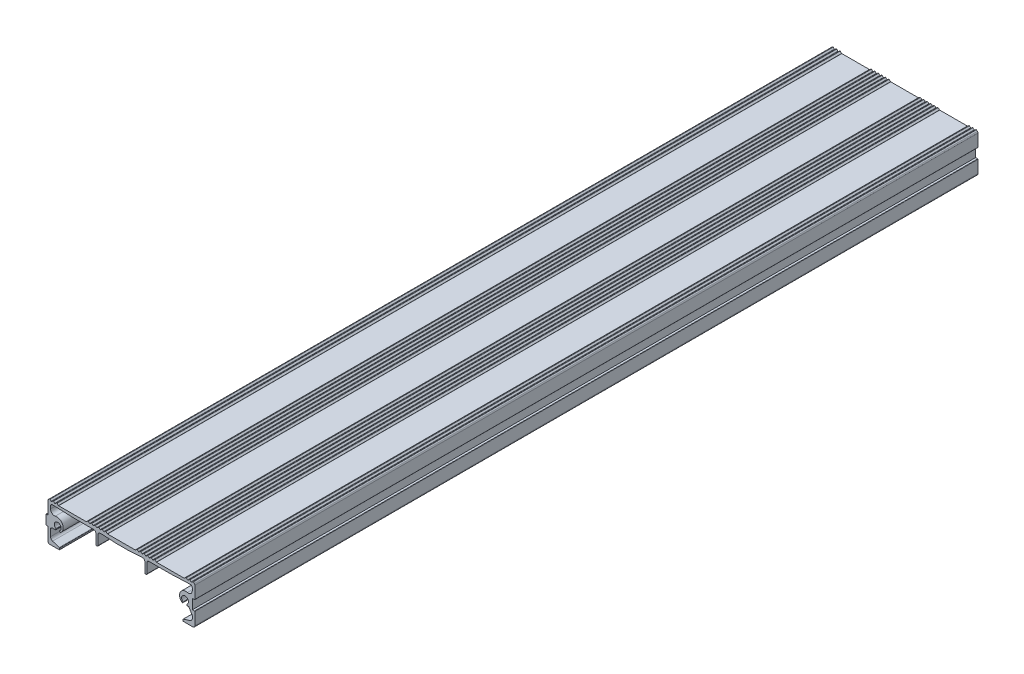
from build123d import *

# Parameters (mm, degrees)
EXTRUDE_1_DEPTH = 800


with BuildPart() as part:
    # Sketch 1 → Extrude 1 (new body)
    with BuildSketch(Plane.XY):
        with BuildLine():
            Line((75.831929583, -4.618869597), (73.731929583, -4.618869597))
            Line((73.731929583, -4.618869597), (73.731929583, 5.381130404))
            Line((73.731929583, 5.381130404), (75.831929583, 5.381130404))
            ThreePointArc((75.831929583, 5.381130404), (76.044061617, 5.46899837), (76.131929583, 5.681130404))
            Line((76.131929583, 5.681130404), (76.131929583, 18.28173049))
            ThreePointArc((76.131929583, 18.28173049), (75.980872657, 18.960379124), (75.556224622, 19.510884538))
            Line((75.556224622, 19.510884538), (74.588003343, 20.317735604))
            ThreePointArc((74.588003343, 20.317735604), (74.331929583, 20.410447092), (74.075855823, 20.317735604))
            Line((74.075855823, 20.317735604), (72.788003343, 19.244525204))
            ThreePointArc((72.788003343, 19.244525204), (72.531929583, 19.151813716), (72.275855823, 19.244525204))
            Line((72.275855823, 19.244525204), (70.988003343, 20.317735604))
            ThreePointArc((70.988003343, 20.317735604), (70.731929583, 20.410447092), (70.475855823, 20.317735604))
            Line((70.475855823, 20.317735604), (69.188003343, 19.244525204))
            ThreePointArc((69.188003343, 19.244525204), (68.931929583, 19.151813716), (68.675855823, 19.244525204))
            Line((68.675855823, 19.244525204), (67.388003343, 20.317735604))
            ThreePointArc((67.388003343, 20.317735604), (67.131929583, 20.410447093), (66.875855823, 20.317735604))
            Line((66.875855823, 20.317735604), (65.443183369, 19.123841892))
            ThreePointArc((65.443183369, 19.123841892), (65.323279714, 19.055021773), (65.187109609, 19.031130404))
            Line((65.187109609, 19.031130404), (37.076749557, 19.031130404))
            ThreePointArc((37.076749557, 19.031130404), (36.940579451, 19.055021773), (36.820675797, 19.123841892))
            Line((36.820675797, 19.123841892), (35.388003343, 20.317735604))
            ThreePointArc((35.388003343, 20.317735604), (35.131929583, 20.410447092), (34.875855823, 20.317735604))
            Line((34.875855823, 20.317735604), (33.588003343, 19.244525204))
            ThreePointArc((33.588003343, 19.244525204), (33.331929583, 19.151813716), (33.075855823, 19.244525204))
            Line((33.075855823, 19.244525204), (31.788003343, 20.317735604))
            ThreePointArc((31.788003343, 20.317735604), (31.531929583, 20.410447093), (31.275855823, 20.317735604))
            Line((31.275855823, 20.317735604), (29.988003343, 19.244525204))
            ThreePointArc((29.988003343, 19.244525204), (29.731929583, 19.151813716), (29.475855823, 19.244525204))
            Line((29.475855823, 19.244525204), (28.188003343, 20.317735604))
            ThreePointArc((28.188003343, 20.317735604), (27.931929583, 20.410447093), (27.675855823, 20.317735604))
            Line((27.675855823, 20.317735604), (26.323984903, 19.191176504))
            ThreePointArc((26.323984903, 19.191176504), (26.131929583, 19.121642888), (25.939874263, 19.191176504))
            Line((25.939874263, 19.191176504), (24.588003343, 20.317735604))
            ThreePointArc((24.588003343, 20.317735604), (24.331929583, 20.410447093), (24.075855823, 20.317735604))
            Line((24.075855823, 20.317735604), (22.788003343, 19.244525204))
            ThreePointArc((22.788003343, 19.244525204), (22.531929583, 19.151813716), (22.275855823, 19.244525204))
            Line((22.275855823, 19.244525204), (20.988003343, 20.317735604))
            ThreePointArc((20.988003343, 20.317735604), (20.731929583, 20.410447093), (20.475855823, 20.317735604))
            Line((20.475855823, 20.317735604), (19.188003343, 19.244525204))
            ThreePointArc((19.188003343, 19.244525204), (18.931929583, 19.151813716), (18.675855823, 19.244525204))
            Line((18.675855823, 19.244525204), (17.388003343, 20.317735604))
            ThreePointArc((17.388003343, 20.317735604), (17.131929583, 20.410447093), (16.875855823, 20.317735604))
            Line((16.875855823, 20.317735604), (15.443183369, 19.123841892))
            ThreePointArc((15.443183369, 19.123841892), (15.323279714, 19.055021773), (15.187109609, 19.031130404))
            Line((15.187109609, 19.031130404), (-12.923250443, 19.031130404))
            ThreePointArc((-12.923250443, 19.031130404), (-13.059420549, 19.055021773), (-13.179324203, 19.123841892))
            Line((-13.179324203, 19.123841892), (-14.611996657, 20.317735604))
            ThreePointArc((-14.611996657, 20.317735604), (-14.868070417, 20.410447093), (-15.124144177, 20.317735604))
            Line((-15.124144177, 20.317735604), (-16.411996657, 19.244525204))
            ThreePointArc((-16.411996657, 19.244525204), (-16.668070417, 19.151813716), (-16.924144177, 19.244525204))
            Line((-16.924144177, 19.244525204), (-18.211996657, 20.317735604))
            ThreePointArc((-18.211996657, 20.317735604), (-18.468070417, 20.410447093), (-18.724144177, 20.317735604))
            Line((-18.724144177, 20.317735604), (-20.011996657, 19.244525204))
            ThreePointArc((-20.011996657, 19.244525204), (-20.268070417, 19.151813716), (-20.524144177, 19.244525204))
            Line((-20.524144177, 19.244525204), (-21.811996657, 20.317735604))
            ThreePointArc((-21.811996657, 20.317735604), (-22.068070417, 20.410447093), (-22.324144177, 20.317735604))
            Line((-22.324144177, 20.317735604), (-23.676015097, 19.191176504))
            ThreePointArc((-23.676015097, 19.191176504), (-23.868070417, 19.121642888), (-24.060125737, 19.191176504))
            Line((-24.060125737, 19.191176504), (-25.411996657, 20.317735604))
            ThreePointArc((-25.411996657, 20.317735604), (-25.668070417, 20.410447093), (-25.924144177, 20.317735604))
            Line((-25.924144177, 20.317735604), (-27.211996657, 19.244525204))
            ThreePointArc((-27.211996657, 19.244525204), (-27.468070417, 19.151813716), (-27.724144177, 19.244525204))
            Line((-27.724144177, 19.244525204), (-29.011996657, 20.317735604))
            ThreePointArc((-29.011996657, 20.317735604), (-29.268070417, 20.410447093), (-29.524144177, 20.317735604))
            Line((-29.524144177, 20.317735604), (-30.811996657, 19.244525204))
            ThreePointArc((-30.811996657, 19.244525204), (-31.068070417, 19.151813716), (-31.324144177, 19.244525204))
            Line((-31.324144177, 19.244525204), (-32.611996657, 20.317735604))
            ThreePointArc((-32.611996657, 20.317735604), (-32.868070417, 20.410447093), (-33.124144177, 20.317735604))
            Line((-33.124144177, 20.317735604), (-34.556816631, 19.123841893))
            ThreePointArc((-34.556816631, 19.123841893), (-34.676720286, 19.055021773), (-34.812890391, 19.031130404))
            Line((-34.812890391, 19.031130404), (-62.923250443, 19.031130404))
            ThreePointArc((-62.923250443, 19.031130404), (-63.059420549, 19.055021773), (-63.179324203, 19.123841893))
            Line((-63.179324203, 19.123841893), (-64.611996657, 20.317735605))
            ThreePointArc((-64.611996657, 20.317735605), (-64.868070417, 20.410447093), (-65.124144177, 20.317735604))
            Line((-65.124144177, 20.317735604), (-66.411996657, 19.244525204))
            ThreePointArc((-66.411996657, 19.244525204), (-66.668070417, 19.151813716), (-66.924144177, 19.244525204))
            Line((-66.924144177, 19.244525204), (-68.211996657, 20.317735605))
            ThreePointArc((-68.211996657, 20.317735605), (-68.468070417, 20.410447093), (-68.724144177, 20.317735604))
            Line((-68.724144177, 20.317735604), (-70.011996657, 19.244525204))
            ThreePointArc((-70.011996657, 19.244525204), (-70.268070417, 19.151813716), (-70.524144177, 19.244525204))
            Line((-70.524144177, 19.244525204), (-71.811996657, 20.317735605))
            ThreePointArc((-71.811996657, 20.317735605), (-72.068070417, 20.410447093), (-72.324144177, 20.317735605))
            Line((-72.324144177, 20.317735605), (-73.292365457, 19.510884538))
            ThreePointArc((-73.292365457, 19.510884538), (-73.717013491, 18.960379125), (-73.868070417, 18.281730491))
            Line((-73.868070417, 18.281730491), (-73.868070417, 5.281130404))
            Line((-73.868070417, 5.281130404), (-75.618070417, 5.281130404))
            ThreePointArc((-75.618070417, 5.281130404), (-75.794847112, 5.2079071), (-75.868070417, 5.031130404))
            Line((-75.868070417, 5.031130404), (-75.868070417, -4.268869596))
            ThreePointArc((-75.868070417, -4.268869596), (-75.794847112, -4.445646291), (-75.618070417, -4.518869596))
            Line((-75.618070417, -4.518869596), (-73.868070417, -4.518869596))
            Line((-73.868070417, -4.518869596), (-73.868070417, -17.618869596))
            ThreePointArc((-73.868070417, -17.618869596), (-73.282283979, -19.033083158), (-71.868070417, -19.618869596))
            Line((-71.868070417, -19.618869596), (-62.368070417, -19.618869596))
            ThreePointArc((-62.368070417, -19.618869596), (-62.014517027, -19.472422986), (-61.868070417, -19.118869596))
            Line((-61.868070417, -19.118869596), (-61.868070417, -17.987868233))
            ThreePointArc((-61.868070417, -17.987868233), (-61.965764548, -17.690967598), (-62.220670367, -17.51008876))
            Line((-62.220670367, -17.51008876), (-69.152470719, -15.371554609))
            ThreePointArc((-69.152470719, -15.371554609), (-70.681905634, -14.286281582), (-71.268070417, -12.504877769))
            Line((-71.268070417, -12.504877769), (-71.268070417, -5.8205358))
            ThreePointArc((-71.268070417, -5.8205358), (-70.68228398, -4.406322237), (-69.268070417, -3.8205358))
            Line((-69.268070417, -3.8205358), (-66.168070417, -3.8205358))
            ThreePointArc((-66.168070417, -3.8205358), (-65.814517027, -3.67408919), (-65.668070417, -3.3205358))
            Line((-65.668070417, -3.3205358), (-65.668070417, -2.89148323))
            ThreePointArc((-65.668070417, -2.89148323), (-65.724364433, -2.660994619), (-65.880570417, -2.482406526))
            ThreePointArc((-65.880570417, -2.482406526), (-63.960631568, 3.879906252), (-61.706980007, -2.371992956))
            ThreePointArc((-61.706980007, -2.371992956), (-61.889943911, -2.67452264), (-61.827062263, -3.02243915))
            Line((-61.827062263, -3.02243915), (-61.62280734, -3.363053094))
            ThreePointArc((-61.62280734, -3.363053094), (-61.288719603, -3.596856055), (-60.891631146, -3.504124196))
            ThreePointArc((-60.891631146, -3.504124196), (-58.917436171, 4.526651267), (-66.359651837, 8.132788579))
            ThreePointArc((-66.359651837, 8.132788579), (-69.754667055, 8.895086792), (-71.268070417, 12.028270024))
            Line((-71.268070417, 12.028270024), (-71.268070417, 14.749159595))
            ThreePointArc((-71.268070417, 14.749159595), (-70.653605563, 16.191481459), (-69.187778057, 16.747547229))
            Line((-69.187778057, 16.747547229), (-48.868070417, 15.931130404))
            Line((-48.868070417, 15.931130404), (-26.968070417, 15.931130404))
            ThreePointArc((-26.968070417, 15.931130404), (-25.553856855, 15.345343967), (-24.968070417, 13.931130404))
            Line((-24.968070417, 13.931130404), (-24.968070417, 3.931130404))
            ThreePointArc((-24.968070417, 3.931130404), (-24.675177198, 3.224023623), (-23.968070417, 2.931130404))
            Line((-23.968070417, 2.931130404), (-23.768070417, 2.931130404))
            ThreePointArc((-23.768070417, 2.931130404), (-23.060963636, 3.224023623), (-22.768070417, 3.931130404))
            Line((-22.768070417, 3.931130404), (-22.768070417, 13.931130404))
            ThreePointArc((-22.768070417, 13.931130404), (-22.18228398, 15.345343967), (-20.768070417, 15.931130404))
            Line((-20.768070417, 15.931130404), (-16.868070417, 15.931130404))
            ThreePointArc((-16.868070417, 15.931130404), (1.131929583, 15.031130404), (19.131929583, 15.931130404))
            Line((19.131929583, 15.931130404), (23.031929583, 15.931130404))
            ThreePointArc((23.031929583, 15.931130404), (24.446143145, 15.345343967), (25.031929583, 13.931130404))
            Line((25.031929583, 13.931130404), (25.031929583, 3.931130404))
            ThreePointArc((25.031929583, 3.931130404), (25.324822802, 3.224023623), (26.031929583, 2.931130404))
            Line((26.031929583, 2.931130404), (26.231929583, 2.931130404))
            ThreePointArc((26.231929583, 2.931130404), (26.939036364, 3.224023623), (27.231929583, 3.931130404))
            Line((27.231929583, 3.931130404), (27.231929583, 13.931130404))
            ThreePointArc((27.231929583, 13.931130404), (27.81771602, 15.345343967), (29.231929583, 15.931130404))
            Line((29.231929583, 15.931130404), (51.131929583, 15.931130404))
            Line((51.131929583, 15.931130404), (71.451637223, 16.747547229))
            ThreePointArc((71.451637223, 16.747547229), (72.917464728, 16.191481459), (73.531929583, 14.749159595))
            Line((73.531929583, 14.749159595), (73.531929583, 12.028270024))
            ThreePointArc((73.531929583, 12.028270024), (72.018526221, 8.895086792), (68.623511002, 8.132788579))
            ThreePointArc((68.623511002, 8.132788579), (61.181295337, 4.526651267), (63.155490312, -3.504124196))
            ThreePointArc((63.155490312, -3.504124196), (63.552578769, -3.596856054), (63.886666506, -3.363053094))
            Line((63.886666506, -3.363053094), (64.090921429, -3.02243915))
            ThreePointArc((64.090921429, -3.02243915), (64.153803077, -2.67452264), (63.970839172, -2.371992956))
            ThreePointArc((63.970839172, -2.371992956), (66.224490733, 3.879906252), (68.144429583, -2.482406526))
            ThreePointArc((68.144429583, -2.482406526), (67.988223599, -2.660994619), (67.931929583, -2.89148323))
            Line((67.931929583, -2.89148323), (67.931929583, -3.3205358))
            ThreePointArc((67.931929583, -3.3205358), (68.078376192, -3.67408919), (68.431929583, -3.8205358))
            Line((68.431929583, -3.8205358), (70.031929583, -3.8205358))
            Line((70.031929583, -3.8205358), (73.531929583, -9.8205358))
            Line((73.531929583, -9.8205358), (73.531929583, -12.504877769))
            ThreePointArc((73.531929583, -12.504877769), (72.945764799, -14.286281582), (71.416329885, -15.371554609))
            Line((71.416329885, -15.371554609), (64.484529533, -17.51008876))
            ThreePointArc((64.484529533, -17.51008876), (64.229623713, -17.690967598), (64.131929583, -17.987868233))
            Line((64.131929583, -17.987868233), (64.131929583, -19.118869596))
            ThreePointArc((64.131929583, -19.118869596), (64.278376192, -19.472422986), (64.631929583, -19.618869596))
            Line((64.631929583, -19.618869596), (74.131929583, -19.618869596))
            ThreePointArc((74.131929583, -19.618869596), (75.546143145, -19.033083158), (76.131929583, -17.618869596))
            Line((76.131929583, -17.618869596), (76.131929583, -4.918869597))
            ThreePointArc((76.131929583, -4.918869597), (76.044061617, -4.706737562), (75.831929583, -4.618869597))
        make_face()
    extrude(amount=EXTRUDE_1_DEPTH)


solid = part.part
